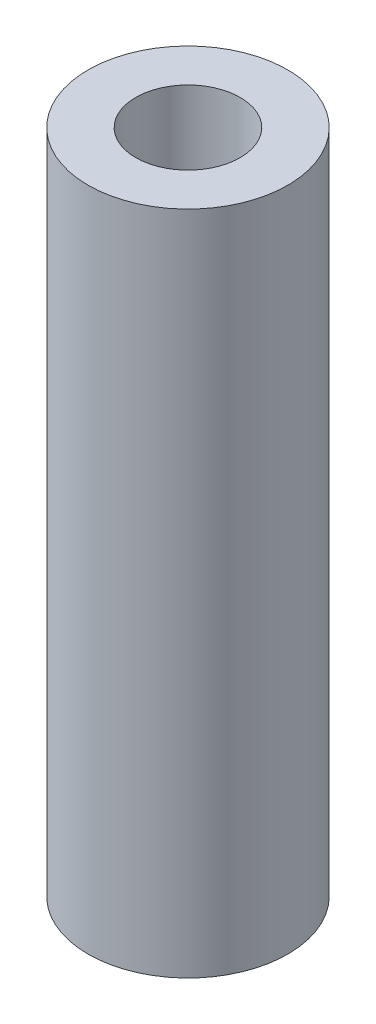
from build123d import *

# Parameters (mm, degrees)
SKETCH1_R           = 4.7625
SKETCH1_R_2         = 2.4892
BOSS_EXTRUDE1_DEPTH = 31.75


with BuildPart() as part:
    # Sketch1 → Boss-Extrude1 (new body)
    with BuildSketch(Plane(origin=(0, 0, 0), x_dir=(1, 0, 0), z_dir=(0, 1, 0))):
        with Locations(Location((0, 0, 0), (0, 0, 270))):
            Circle(SKETCH1_R)
        with Locations(Location((0, 0, 0), (0, 0, 270))):
            Circle(SKETCH1_R_2, mode=Mode.SUBTRACT)
    extrude(amount=BOSS_EXTRUDE1_DEPTH)


solid = part.part
